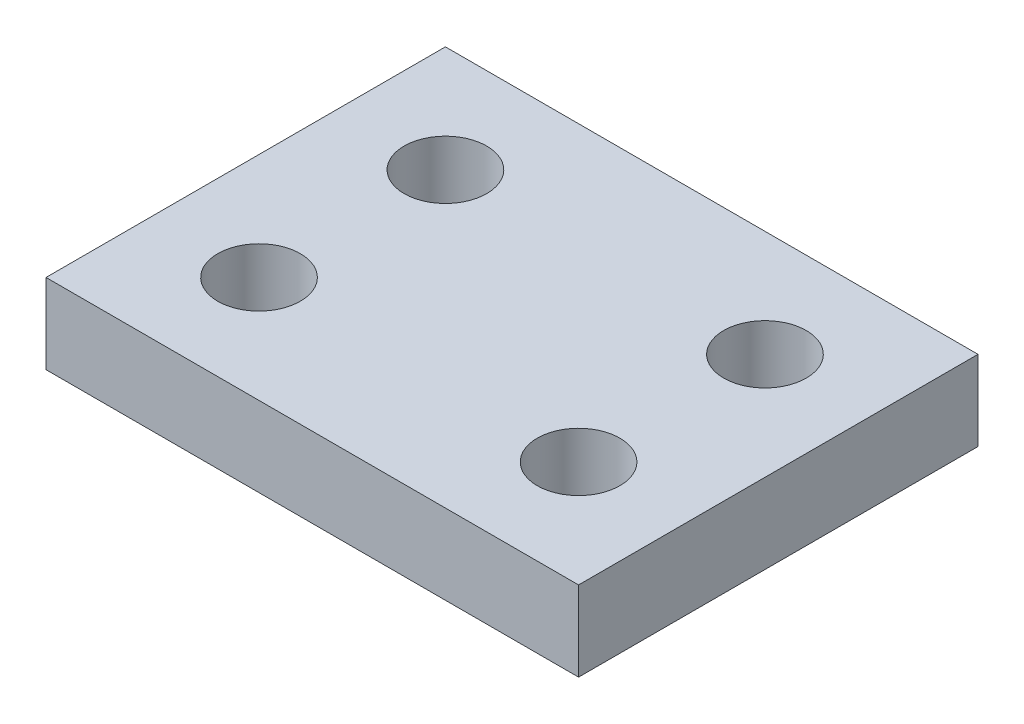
ISO-10303-21;
HEADER;
FILE_DESCRIPTION(('STEP AP214'),'2;1');
FILE_NAME('part.step','',(''),(''),'','','');
FILE_SCHEMA(('AUTOMOTIVE_DESIGN { 1 0 10303 214 1 1 1 1 }'));
ENDSEC;
DATA;
#1=APPLICATION_CONTEXT('core data for automotive mechanical design processes');
#2=APPLICATION_PROTOCOL_DEFINITION('international standard','automotive_design',2000,#1);
#3=PRODUCT_CONTEXT('',#1,'mechanical');
#4=PRODUCT('Part','Part','',(#3));
#5=PRODUCT_RELATED_PRODUCT_CATEGORY('part','',(#4));
#6=PRODUCT_DEFINITION_FORMATION('','',#4);
#7=PRODUCT_DEFINITION_CONTEXT('part definition',#1,'design');
#8=PRODUCT_DEFINITION('design','',#6,#7);
#9=PRODUCT_DEFINITION_SHAPE('','',#8);
#10=(LENGTH_UNIT() NAMED_UNIT(*) SI_UNIT(.MILLI.,.METRE.));
#11=(NAMED_UNIT(*) PLANE_ANGLE_UNIT() SI_UNIT($,.RADIAN.));
#12=(NAMED_UNIT(*) SI_UNIT($,.STERADIAN.) SOLID_ANGLE_UNIT());
#13=UNCERTAINTY_MEASURE_WITH_UNIT(LENGTH_MEASURE(1.E-05),#10,'distance_accuracy_value','');
#14=(GEOMETRIC_REPRESENTATION_CONTEXT(3) GLOBAL_UNCERTAINTY_ASSIGNED_CONTEXT((#13)) GLOBAL_UNIT_ASSIGNED_CONTEXT((#10,
#11,#12)) REPRESENTATION_CONTEXT('',''));
#15=CARTESIAN_POINT('',(0.,0.,0.));
#16=DIRECTION('',(0.,0.,1.));
#17=DIRECTION('',(1.,0.,0.));
#18=AXIS2_PLACEMENT_3D('',#15,#16,#17);
#19=CARTESIAN_POINT('',(50.,15.,37.5));
#20=DIRECTION('',(-1.,0.,0.));
#21=DIRECTION('',(0.,0.,1.));
#22=AXIS2_PLACEMENT_3D('',#19,#20,#21);
#23=PLANE('',#22);
#24=DIRECTION('',(0.,0.,-1.));
#25=VECTOR('',#24,1.);
#26=CARTESIAN_POINT('',(50.,0.,37.5));
#27=LINE('',#26,#25);
#28=CARTESIAN_POINT('',(50.,0.,37.5));
#29=VERTEX_POINT('',#28);
#30=CARTESIAN_POINT('',(50.,0.,-37.5));
#31=VERTEX_POINT('',#30);
#32=EDGE_CURVE('E97',#29,#31,#27,.T.);
#33=ORIENTED_EDGE('',*,*,#32,.T.);
#34=DIRECTION('',(0.,-1.,0.));
#35=VECTOR('',#34,1.);
#36=CARTESIAN_POINT('',(50.,15.,-37.5));
#37=LINE('',#36,#35);
#38=CARTESIAN_POINT('',(50.,15.,-37.5));
#39=VERTEX_POINT('',#38);
#40=EDGE_CURVE('E11',#39,#31,#37,.T.);
#41=ORIENTED_EDGE('',*,*,#40,.F.);
#42=DIRECTION('',(0.,0.,-1.));
#43=VECTOR('',#42,1.);
#44=CARTESIAN_POINT('',(50.,15.,37.5));
#45=LINE('',#44,#43);
#46=CARTESIAN_POINT('',(50.,15.,37.5));
#47=VERTEX_POINT('',#46);
#48=EDGE_CURVE('E85',#47,#39,#45,.T.);
#49=ORIENTED_EDGE('',*,*,#48,.F.);
#50=DIRECTION('',(0.,-1.,0.));
#51=VECTOR('',#50,1.);
#52=CARTESIAN_POINT('',(50.,15.,37.5));
#53=LINE('',#52,#51);
#54=EDGE_CURVE('E93',#47,#29,#53,.T.);
#55=ORIENTED_EDGE('',*,*,#54,.T.);
#56=EDGE_LOOP('',(#33,#41,#49,#55));
#57=FACE_BOUND('',#56,.T.);
#58=ADVANCED_FACE('F34',(#57),#23,.F.);
#59=CARTESIAN_POINT('',(-50.,15.,-37.5));
#60=DIRECTION('',(0.,0.,1.));
#61=DIRECTION('',(1.,0.,0.));
#62=AXIS2_PLACEMENT_3D('',#59,#60,#61);
#63=PLANE('',#62);
#64=DIRECTION('',(-1.,0.,0.));
#65=VECTOR('',#64,1.);
#66=CARTESIAN_POINT('',(-50.,0.,-37.5));
#67=LINE('',#66,#65);
#68=CARTESIAN_POINT('',(-50.,0.,-37.5));
#69=VERTEX_POINT('',#68);
#70=EDGE_CURVE('E89',#31,#69,#67,.T.);
#71=ORIENTED_EDGE('',*,*,#70,.T.);
#72=DIRECTION('',(0.,-1.,0.));
#73=VECTOR('',#72,1.);
#74=CARTESIAN_POINT('',(-50.,15.,-37.5));
#75=LINE('',#74,#73);
#76=CARTESIAN_POINT('',(-50.,15.,-37.5));
#77=VERTEX_POINT('',#76);
#78=EDGE_CURVE('E42',#77,#69,#75,.T.);
#79=ORIENTED_EDGE('',*,*,#78,.F.);
#80=DIRECTION('',(-1.,0.,0.));
#81=VECTOR('',#80,1.);
#82=CARTESIAN_POINT('',(-50.,15.,-37.5));
#83=LINE('',#82,#81);
#84=EDGE_CURVE('E80',#39,#77,#83,.T.);
#85=ORIENTED_EDGE('',*,*,#84,.F.);
#86=ORIENTED_EDGE('',*,*,#40,.T.);
#87=EDGE_LOOP('',(#71,#79,#85,#86));
#88=FACE_BOUND('',#87,.T.);
#89=ADVANCED_FACE('F88',(#88),#63,.F.);
#90=CARTESIAN_POINT('',(-50.,15.,37.5));
#91=DIRECTION('',(1.,0.,0.));
#92=DIRECTION('',(0.,0.,-1.));
#93=AXIS2_PLACEMENT_3D('',#90,#91,#92);
#94=PLANE('',#93);
#95=DIRECTION('',(0.,0.,1.));
#96=VECTOR('',#95,1.);
#97=CARTESIAN_POINT('',(-50.,0.,37.5));
#98=LINE('',#97,#96);
#99=CARTESIAN_POINT('',(-50.,0.,37.5));
#100=VERTEX_POINT('',#99);
#101=EDGE_CURVE('E67',#69,#100,#98,.T.);
#102=ORIENTED_EDGE('',*,*,#101,.T.);
#103=DIRECTION('',(0.,-1.,0.));
#104=VECTOR('',#103,1.);
#105=CARTESIAN_POINT('',(-50.,15.,37.5));
#106=LINE('',#105,#104);
#107=CARTESIAN_POINT('',(-50.,15.,37.5));
#108=VERTEX_POINT('',#107);
#109=EDGE_CURVE('E90',#108,#100,#106,.T.);
#110=ORIENTED_EDGE('',*,*,#109,.F.);
#111=DIRECTION('',(0.,0.,1.));
#112=VECTOR('',#111,1.);
#113=CARTESIAN_POINT('',(-50.,15.,37.5));
#114=LINE('',#113,#112);
#115=EDGE_CURVE('E83',#77,#108,#114,.T.);
#116=ORIENTED_EDGE('',*,*,#115,.F.);
#117=ORIENTED_EDGE('',*,*,#78,.T.);
#118=EDGE_LOOP('',(#102,#110,#116,#117));
#119=FACE_BOUND('',#118,.T.);
#120=ADVANCED_FACE('F91',(#119),#94,.F.);
#121=CARTESIAN_POINT('',(-50.,15.,37.5));
#122=DIRECTION('',(0.,0.,-1.));
#123=DIRECTION('',(-1.,0.,0.));
#124=AXIS2_PLACEMENT_3D('',#121,#122,#123);
#125=PLANE('',#124);
#126=DIRECTION('',(1.,0.,0.));
#127=VECTOR('',#126,1.);
#128=CARTESIAN_POINT('',(-50.,0.,37.5));
#129=LINE('',#128,#127);
#130=EDGE_CURVE('E73',#100,#29,#129,.T.);
#131=ORIENTED_EDGE('',*,*,#130,.T.);
#132=ORIENTED_EDGE('',*,*,#54,.F.);
#133=DIRECTION('',(1.,0.,0.));
#134=VECTOR('',#133,1.);
#135=CARTESIAN_POINT('',(-50.,15.,37.5));
#136=LINE('',#135,#134);
#137=EDGE_CURVE('E50',#108,#47,#136,.T.);
#138=ORIENTED_EDGE('',*,*,#137,.F.);
#139=ORIENTED_EDGE('',*,*,#109,.T.);
#140=EDGE_LOOP('',(#131,#132,#138,#139));
#141=FACE_BOUND('',#140,.T.);
#142=ADVANCED_FACE('F105',(#141),#125,.F.);
#143=CARTESIAN_POINT('',(0.,15.,0.));
#144=DIRECTION('',(0.,-1.,0.));
#145=DIRECTION('',(0.,0.,-1.));
#146=AXIS2_PLACEMENT_3D('',#143,#144,#145);
#147=PLANE('',#146);
#148=CARTESIAN_POINT('',(-30.,15.,17.5));
#149=DIRECTION('',(0.,1.,0.));
#150=DIRECTION('',(0.,0.,1.));
#151=AXIS2_PLACEMENT_3D('',#148,#149,#150);
#152=CIRCLE('',#151,7.75);
#153=CARTESIAN_POINT('',(-30.,15.,25.25));
#154=VERTEX_POINT('',#153);
#155=EDGE_CURVE('E131',#154,#154,#152,.T.);
#156=ORIENTED_EDGE('',*,*,#155,.F.);
#157=EDGE_LOOP('',(#156));
#158=FACE_BOUND('',#157,.T.);
#159=CARTESIAN_POINT('',(-30.,15.,-17.5));
#160=DIRECTION('',(0.,1.,0.));
#161=DIRECTION('',(0.,0.,1.));
#162=AXIS2_PLACEMENT_3D('',#159,#160,#161);
#163=CIRCLE('',#162,7.75);
#164=CARTESIAN_POINT('',(-30.,15.,-9.75));
#165=VERTEX_POINT('',#164);
#166=EDGE_CURVE('E125',#165,#165,#163,.T.);
#167=ORIENTED_EDGE('',*,*,#166,.F.);
#168=EDGE_LOOP('',(#167));
#169=FACE_BOUND('',#168,.T.);
#170=CARTESIAN_POINT('',(30.,15.,-17.5));
#171=DIRECTION('',(0.,1.,0.));
#172=DIRECTION('',(0.,0.,1.));
#173=AXIS2_PLACEMENT_3D('',#170,#171,#172);
#174=CIRCLE('',#173,7.75);
#175=CARTESIAN_POINT('',(30.,15.,-9.75));
#176=VERTEX_POINT('',#175);
#177=EDGE_CURVE('E119',#176,#176,#174,.T.);
#178=ORIENTED_EDGE('',*,*,#177,.F.);
#179=EDGE_LOOP('',(#178));
#180=FACE_BOUND('',#179,.T.);
#181=CARTESIAN_POINT('',(30.,15.,17.5));
#182=DIRECTION('',(0.,1.,0.));
#183=DIRECTION('',(0.,0.,1.));
#184=AXIS2_PLACEMENT_3D('',#181,#182,#183);
#185=CIRCLE('',#184,7.75);
#186=CARTESIAN_POINT('',(30.,15.,25.25));
#187=VERTEX_POINT('',#186);
#188=EDGE_CURVE('E113',#187,#187,#185,.T.);
#189=ORIENTED_EDGE('',*,*,#188,.F.);
#190=EDGE_LOOP('',(#189));
#191=FACE_BOUND('',#190,.T.);
#192=ORIENTED_EDGE('',*,*,#48,.T.);
#193=ORIENTED_EDGE('',*,*,#84,.T.);
#194=ORIENTED_EDGE('',*,*,#115,.T.);
#195=ORIENTED_EDGE('',*,*,#137,.T.);
#196=EDGE_LOOP('',(#192,#193,#194,#195));
#197=FACE_BOUND('',#196,.T.);
#198=ADVANCED_FACE('F81',(#158,#169,#180,#191,#197),#147,.F.);
#199=CARTESIAN_POINT('',(0.,0.,0.));
#200=DIRECTION('',(0.,-1.,0.));
#201=DIRECTION('',(0.,0.,-1.));
#202=AXIS2_PLACEMENT_3D('',#199,#200,#201);
#203=PLANE('',#202);
#204=CARTESIAN_POINT('',(-30.,0.,17.5));
#205=DIRECTION('',(0.,1.,0.));
#206=DIRECTION('',(0.,0.,1.));
#207=AXIS2_PLACEMENT_3D('',#204,#205,#206);
#208=CIRCLE('',#207,7.75);
#209=CARTESIAN_POINT('',(-30.,0.,25.25));
#210=VERTEX_POINT('',#209);
#211=EDGE_CURVE('E128',#210,#210,#208,.T.);
#212=ORIENTED_EDGE('',*,*,#211,.T.);
#213=EDGE_LOOP('',(#212));
#214=FACE_BOUND('',#213,.T.);
#215=CARTESIAN_POINT('',(-30.,0.,-17.5));
#216=DIRECTION('',(0.,1.,0.));
#217=DIRECTION('',(0.,0.,1.));
#218=AXIS2_PLACEMENT_3D('',#215,#216,#217);
#219=CIRCLE('',#218,7.75);
#220=CARTESIAN_POINT('',(-30.,0.,-9.75));
#221=VERTEX_POINT('',#220);
#222=EDGE_CURVE('E122',#221,#221,#219,.T.);
#223=ORIENTED_EDGE('',*,*,#222,.T.);
#224=EDGE_LOOP('',(#223));
#225=FACE_BOUND('',#224,.T.);
#226=CARTESIAN_POINT('',(30.,0.,-17.5));
#227=DIRECTION('',(0.,1.,0.));
#228=DIRECTION('',(0.,0.,1.));
#229=AXIS2_PLACEMENT_3D('',#226,#227,#228);
#230=CIRCLE('',#229,7.75);
#231=CARTESIAN_POINT('',(30.,0.,-9.75));
#232=VERTEX_POINT('',#231);
#233=EDGE_CURVE('E116',#232,#232,#230,.T.);
#234=ORIENTED_EDGE('',*,*,#233,.T.);
#235=EDGE_LOOP('',(#234));
#236=FACE_BOUND('',#235,.T.);
#237=CARTESIAN_POINT('',(30.,0.,17.5));
#238=DIRECTION('',(0.,1.,0.));
#239=DIRECTION('',(0.,0.,1.));
#240=AXIS2_PLACEMENT_3D('',#237,#238,#239);
#241=CIRCLE('',#240,7.75);
#242=CARTESIAN_POINT('',(30.,0.,25.25));
#243=VERTEX_POINT('',#242);
#244=EDGE_CURVE('E100',#243,#243,#241,.T.);
#245=ORIENTED_EDGE('',*,*,#244,.T.);
#246=EDGE_LOOP('',(#245));
#247=FACE_BOUND('',#246,.T.);
#248=ORIENTED_EDGE('',*,*,#32,.F.);
#249=ORIENTED_EDGE('',*,*,#130,.F.);
#250=ORIENTED_EDGE('',*,*,#101,.F.);
#251=ORIENTED_EDGE('',*,*,#70,.F.);
#252=EDGE_LOOP('',(#248,#249,#250,#251));
#253=FACE_BOUND('',#252,.T.);
#254=ADVANCED_FACE('F108',(#214,#225,#236,#247,#253),#203,.T.);
#255=CARTESIAN_POINT('',(30.,15.,17.5));
#256=DIRECTION('',(0.,1.,0.));
#257=DIRECTION('',(0.,0.,1.));
#258=AXIS2_PLACEMENT_3D('',#255,#256,#257);
#259=CYLINDRICAL_SURFACE('',#258,7.75);
#260=ORIENTED_EDGE('',*,*,#244,.F.);
#261=EDGE_LOOP('',(#260));
#262=FACE_BOUND('',#261,.T.);
#263=ORIENTED_EDGE('',*,*,#188,.T.);
#264=EDGE_LOOP('',(#263));
#265=FACE_BOUND('',#264,.T.);
#266=ADVANCED_FACE('F146',(#262,#265),#259,.F.);
#267=CARTESIAN_POINT('',(30.,15.,-17.5));
#268=DIRECTION('',(0.,1.,0.));
#269=DIRECTION('',(0.,0.,1.));
#270=AXIS2_PLACEMENT_3D('',#267,#268,#269);
#271=CYLINDRICAL_SURFACE('',#270,7.75);
#272=ORIENTED_EDGE('',*,*,#233,.F.);
#273=EDGE_LOOP('',(#272));
#274=FACE_BOUND('',#273,.T.);
#275=ORIENTED_EDGE('',*,*,#177,.T.);
#276=EDGE_LOOP('',(#275));
#277=FACE_BOUND('',#276,.T.);
#278=ADVANCED_FACE('F148',(#274,#277),#271,.F.);
#279=CARTESIAN_POINT('',(-30.,15.,-17.5));
#280=DIRECTION('',(0.,1.,0.));
#281=DIRECTION('',(0.,0.,1.));
#282=AXIS2_PLACEMENT_3D('',#279,#280,#281);
#283=CYLINDRICAL_SURFACE('',#282,7.75);
#284=ORIENTED_EDGE('',*,*,#222,.F.);
#285=EDGE_LOOP('',(#284));
#286=FACE_BOUND('',#285,.T.);
#287=ORIENTED_EDGE('',*,*,#166,.T.);
#288=EDGE_LOOP('',(#287));
#289=FACE_BOUND('',#288,.T.);
#290=ADVANCED_FACE('F155',(#286,#289),#283,.F.);
#291=CARTESIAN_POINT('',(-30.,15.,17.5));
#292=DIRECTION('',(0.,1.,0.));
#293=DIRECTION('',(0.,0.,1.));
#294=AXIS2_PLACEMENT_3D('',#291,#292,#293);
#295=CYLINDRICAL_SURFACE('',#294,7.75);
#296=ORIENTED_EDGE('',*,*,#211,.F.);
#297=EDGE_LOOP('',(#296));
#298=FACE_BOUND('',#297,.T.);
#299=ORIENTED_EDGE('',*,*,#155,.T.);
#300=EDGE_LOOP('',(#299));
#301=FACE_BOUND('',#300,.T.);
#302=ADVANCED_FACE('F135',(#298,#301),#295,.F.);
#303=CLOSED_SHELL('',(#58,#89,#120,#142,#198,#254,#266,#278,#290,#302));
#304=MANIFOLD_SOLID_BREP('B2',#303);
#305=ADVANCED_BREP_SHAPE_REPRESENTATION('',(#18,#304),#14);
#306=SHAPE_DEFINITION_REPRESENTATION(#9,#305);
ENDSEC;
END-ISO-10303-21;
